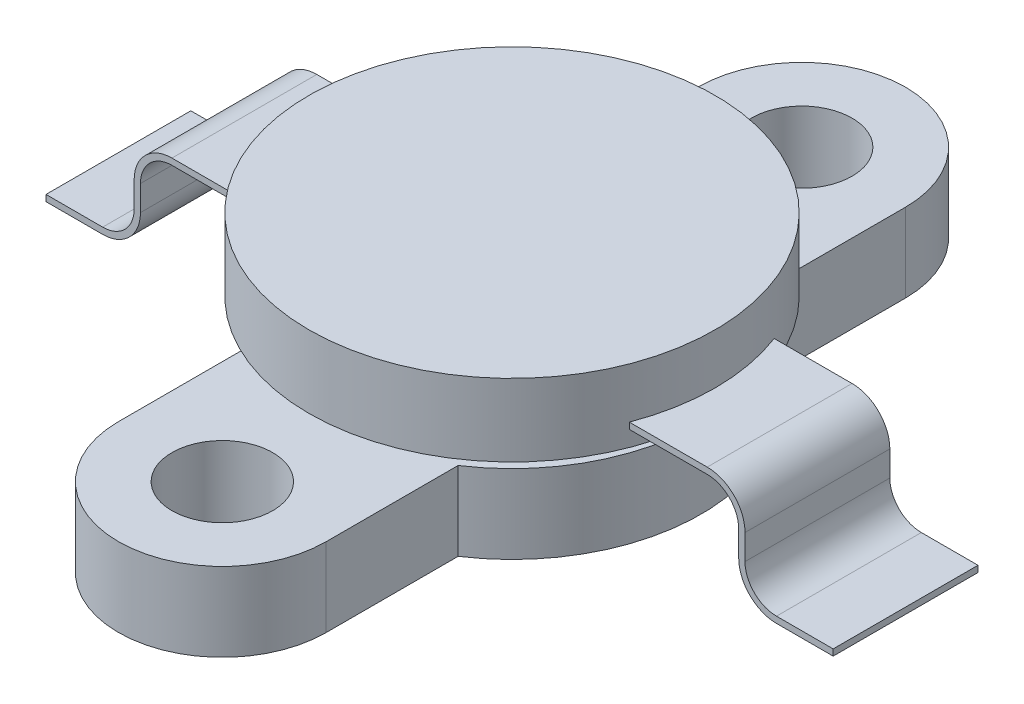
from build123d import *

# Parameters (mm, degrees)
SKETCH_1_R      = 1.6
EXTRUDE_1_DEPTH = 2.5
SKETCH_2_R      = 3.75
EXTRUDE_2_DEPTH = 0.5
SKETCH_3_R      = 6.45
EXTRUDE_3_DEPTH = 2.3
SKETCH_5_W      = 4.6
SKETCH_5_H      = 0.2


with BuildPart() as part:
    # Sketch 1 → Extrude 1 (new body)
    with BuildSketch(Plane(origin=(0, 0, 0), x_dir=(1, 0, 0), z_dir=(0, 1, 0))):
        with BuildLine():
            Line((-3.3, 9.2), (-3.3, 5.010987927))
            ThreePointArc((-3.3, 5.010987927), (-6, 0), (-3.3, -5.010987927))
            Line((-3.3, -5.010987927), (-3.3, -9.2))
            ThreePointArc((-3.3, -9.2), (0, -12.5), (3.3, -9.2))
            Line((3.3, -9.2), (3.3, -5.010987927))
            ThreePointArc((3.3, -5.010987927), (6, 0), (3.3, 5.010987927))
            Line((3.3, 5.010987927), (3.3, 9.2))
            ThreePointArc((3.3, 9.2), (0, 12.5), (-3.3, 9.2))
        make_face()
        with Locations(Location((0, 9.2, 0), (0, 0, 270))):
            Circle(SKETCH_1_R, mode=Mode.SUBTRACT)
        with Locations(Location((0, -9.2, 0), (0, 0, 270))):
            Circle(SKETCH_1_R, mode=Mode.SUBTRACT)
    extrude(amount=EXTRUDE_1_DEPTH)

    # Sketch 2 → Extrude 2 (add)
    with BuildSketch(Plane(origin=(0, 2.5, 0), x_dir=(-1, 0, 0), z_dir=(0, 1, 0))):
        with Locations(Location((0, 0, 0), (0, 0, 90))):
            Circle(SKETCH_2_R)
    extrude(amount=EXTRUDE_2_DEPTH)

    # Sketch 3 → Extrude 3 (add)
    with BuildSketch(Plane(origin=(0, 3, 0), x_dir=(-1, 0, 0), z_dir=(0, 1, 0))):
        with Locations(Location((0, 0, 0), (0, 0, 90))):
            Circle(SKETCH_3_R)
    extrude(amount=EXTRUDE_3_DEPTH)

    # Sweep 2: sweep along a path in Sketch 4
    with BuildLine(Plane.XY) as sweep_2_path:
        Line((12.5, 0.5), (10.7, 0.5))
        ThreePointArc((10.7, 0.5), (9.851471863, 0.851471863), (9.5, 1.7))
        Line((9.5, 1.7), (9.5, 2.5))
        ThreePointArc((9.5, 2.5), (9.207106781, 3.207106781), (8.5, 3.5))
        Line((8.5, 3.5), (-8.5, 3.5))
        ThreePointArc((-8.5, 3.5), (-9.207106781, 3.207106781), (-9.5, 2.5))
        Line((-9.5, 2.5), (-9.5, 1.7))
        ThreePointArc((-9.5, 1.7), (-9.851471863, 0.851471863), (-10.7, 0.5))
        Line((-10.7, 0.5), (-12.5, 0.5))
    # Sketch 5 → Sweep 2 (sweep)
    with BuildSketch(Plane(origin=(12.5, 0, 0), x_dir=(0, 0, -1), z_dir=(1, 0, 0))):
        with Locations((0, 0.6)):
            Rectangle(SKETCH_5_W, SKETCH_5_H)
    sweep(path=sweep_2_path.line)


solid = part.part
